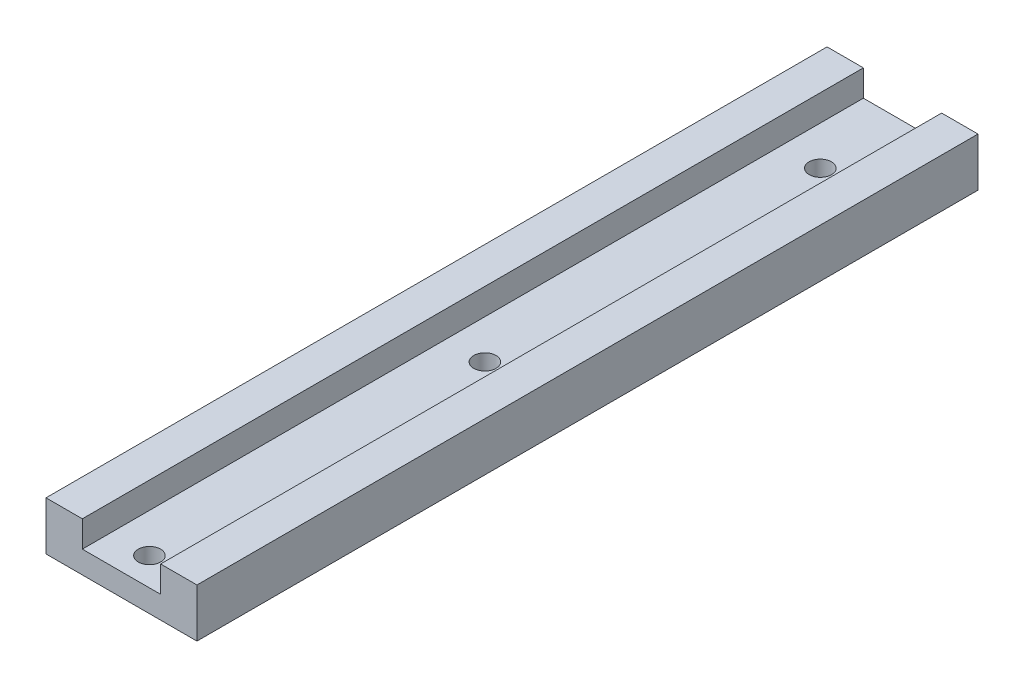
ISO-10303-21;
HEADER;
FILE_DESCRIPTION(('STEP AP214'),'2;1');
FILE_NAME('part.step','',(''),(''),'','','');
FILE_SCHEMA(('AUTOMOTIVE_DESIGN { 1 0 10303 214 1 1 1 1 }'));
ENDSEC;
DATA;
#1=APPLICATION_CONTEXT('core data for automotive mechanical design processes');
#2=APPLICATION_PROTOCOL_DEFINITION('international standard','automotive_design',2000,#1);
#3=PRODUCT_CONTEXT('',#1,'mechanical');
#4=PRODUCT('Part','Part','',(#3));
#5=PRODUCT_RELATED_PRODUCT_CATEGORY('part','',(#4));
#6=PRODUCT_DEFINITION_FORMATION('','',#4);
#7=PRODUCT_DEFINITION_CONTEXT('part definition',#1,'design');
#8=PRODUCT_DEFINITION('design','',#6,#7);
#9=PRODUCT_DEFINITION_SHAPE('','',#8);
#10=(LENGTH_UNIT() NAMED_UNIT(*) SI_UNIT(.MILLI.,.METRE.));
#11=(NAMED_UNIT(*) PLANE_ANGLE_UNIT() SI_UNIT($,.RADIAN.));
#12=(NAMED_UNIT(*) SI_UNIT($,.STERADIAN.) SOLID_ANGLE_UNIT());
#13=UNCERTAINTY_MEASURE_WITH_UNIT(LENGTH_MEASURE(1.E-05),#10,'distance_accuracy_value','');
#14=(GEOMETRIC_REPRESENTATION_CONTEXT(3) GLOBAL_UNCERTAINTY_ASSIGNED_CONTEXT((#13)) GLOBAL_UNIT_ASSIGNED_CONTEXT((#10,
#11,#12)) REPRESENTATION_CONTEXT('',''));
#15=CARTESIAN_POINT('',(0.,0.,0.));
#16=DIRECTION('',(0.,0.,1.));
#17=DIRECTION('',(1.,0.,0.));
#18=AXIS2_PLACEMENT_3D('',#15,#16,#17);
#19=CARTESIAN_POINT('',(13.5,-4.35,139.7));
#20=DIRECTION('',(-1.,0.,0.));
#21=DIRECTION('',(0.,-1.,0.));
#22=AXIS2_PLACEMENT_3D('',#19,#20,#21);
#23=PLANE('',#22);
#24=DIRECTION('',(0.,1.,0.));
#25=VECTOR('',#24,1.);
#26=CARTESIAN_POINT('',(13.5,-4.35,0.));
#27=LINE('',#26,#25);
#28=CARTESIAN_POINT('',(13.5,-4.35,0.));
#29=VERTEX_POINT('',#28);
#30=CARTESIAN_POINT('',(13.5,4.35,0.));
#31=VERTEX_POINT('',#30);
#32=EDGE_CURVE('E131',#29,#31,#27,.T.);
#33=ORIENTED_EDGE('',*,*,#32,.T.);
#34=DIRECTION('',(0.,0.,-1.));
#35=VECTOR('',#34,1.);
#36=CARTESIAN_POINT('',(13.5,4.35,139.7));
#37=LINE('',#36,#35);
#38=CARTESIAN_POINT('',(13.5,4.35,139.7));
#39=VERTEX_POINT('',#38);
#40=EDGE_CURVE('E159',#39,#31,#37,.T.);
#41=ORIENTED_EDGE('',*,*,#40,.F.);
#42=DIRECTION('',(0.,1.,0.));
#43=VECTOR('',#42,1.);
#44=CARTESIAN_POINT('',(13.5,-4.35,139.7));
#45=LINE('',#44,#43);
#46=CARTESIAN_POINT('',(13.5,-4.35,139.7));
#47=VERTEX_POINT('',#46);
#48=EDGE_CURVE('E146',#47,#39,#45,.T.);
#49=ORIENTED_EDGE('',*,*,#48,.F.);
#50=DIRECTION('',(0.,0.,-1.));
#51=VECTOR('',#50,1.);
#52=CARTESIAN_POINT('',(13.5,-4.35,139.7));
#53=LINE('',#52,#51);
#54=EDGE_CURVE('E127',#47,#29,#53,.T.);
#55=ORIENTED_EDGE('',*,*,#54,.T.);
#56=EDGE_LOOP('',(#33,#41,#49,#55));
#57=FACE_BOUND('',#56,.T.);
#58=ADVANCED_FACE('F33',(#57),#23,.F.);
#59=CARTESIAN_POINT('',(7.,4.35,139.7));
#60=DIRECTION('',(0.,-1.,0.));
#61=DIRECTION('',(1.,0.,0.));
#62=AXIS2_PLACEMENT_3D('',#59,#60,#61);
#63=PLANE('',#62);
#64=DIRECTION('',(-1.,0.,0.));
#65=VECTOR('',#64,1.);
#66=CARTESIAN_POINT('',(7.,4.35,0.));
#67=LINE('',#66,#65);
#68=CARTESIAN_POINT('',(7.,4.35,0.));
#69=VERTEX_POINT('',#68);
#70=EDGE_CURVE('E134',#31,#69,#67,.T.);
#71=ORIENTED_EDGE('',*,*,#70,.T.);
#72=DIRECTION('',(0.,0.,-1.));
#73=VECTOR('',#72,1.);
#74=CARTESIAN_POINT('',(7.,4.35,139.7));
#75=LINE('',#74,#73);
#76=CARTESIAN_POINT('',(7.,4.35,139.7));
#77=VERTEX_POINT('',#76);
#78=EDGE_CURVE('E156',#77,#69,#75,.T.);
#79=ORIENTED_EDGE('',*,*,#78,.F.);
#80=DIRECTION('',(-1.,0.,0.));
#81=VECTOR('',#80,1.);
#82=CARTESIAN_POINT('',(7.,4.35,139.7));
#83=LINE('',#82,#81);
#84=EDGE_CURVE('E94',#39,#77,#83,.T.);
#85=ORIENTED_EDGE('',*,*,#84,.F.);
#86=ORIENTED_EDGE('',*,*,#40,.T.);
#87=EDGE_LOOP('',(#71,#79,#85,#86));
#88=FACE_BOUND('',#87,.T.);
#89=ADVANCED_FACE('F182',(#88),#63,.F.);
#90=CARTESIAN_POINT('',(7.,4.35,139.7));
#91=DIRECTION('',(1.,0.,0.));
#92=DIRECTION('',(0.,1.,0.));
#93=AXIS2_PLACEMENT_3D('',#90,#91,#92);
#94=PLANE('',#93);
#95=DIRECTION('',(0.,-1.,0.));
#96=VECTOR('',#95,1.);
#97=CARTESIAN_POINT('',(7.,4.35,0.));
#98=LINE('',#97,#96);
#99=CARTESIAN_POINT('',(7.,-0.349999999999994,0.));
#100=VERTEX_POINT('',#99);
#101=EDGE_CURVE('E137',#69,#100,#98,.T.);
#102=ORIENTED_EDGE('',*,*,#101,.T.);
#103=DIRECTION('',(0.,0.,-1.));
#104=VECTOR('',#103,1.);
#105=CARTESIAN_POINT('',(7.,-0.349999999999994,139.7));
#106=LINE('',#105,#104);
#107=CARTESIAN_POINT('',(7.,-0.349999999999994,139.7));
#108=VERTEX_POINT('',#107);
#109=EDGE_CURVE('E153',#108,#100,#106,.T.);
#110=ORIENTED_EDGE('',*,*,#109,.F.);
#111=DIRECTION('',(0.,-1.,0.));
#112=VECTOR('',#111,1.);
#113=CARTESIAN_POINT('',(7.,4.35,139.7));
#114=LINE('',#113,#112);
#115=EDGE_CURVE('E202',#77,#108,#114,.T.);
#116=ORIENTED_EDGE('',*,*,#115,.F.);
#117=ORIENTED_EDGE('',*,*,#78,.T.);
#118=EDGE_LOOP('',(#102,#110,#116,#117));
#119=FACE_BOUND('',#118,.T.);
#120=ADVANCED_FACE('F173',(#119),#94,.F.);
#121=CARTESIAN_POINT('',(-7.,-0.349999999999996,139.7));
#122=DIRECTION('',(0.,-1.,0.));
#123=DIRECTION('',(1.,0.,0.));
#124=AXIS2_PLACEMENT_3D('',#121,#122,#123);
#125=PLANE('',#124);
#126=CARTESIAN_POINT('',(0.,-0.349999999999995,74.7));
#127=DIRECTION('',(0.,1.,0.));
#128=DIRECTION('',(-1.,0.,0.));
#129=AXIS2_PLACEMENT_3D('',#126,#127,#128);
#130=CIRCLE('',#129,2.);
#131=CARTESIAN_POINT('',(-2.,-0.349999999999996,74.7));
#132=VERTEX_POINT('',#131);
#133=EDGE_CURVE('E213',#132,#132,#130,.T.);
#134=ORIENTED_EDGE('',*,*,#133,.F.);
#135=EDGE_LOOP('',(#134));
#136=FACE_BOUND('',#135,.T.);
#137=CARTESIAN_POINT('',(0.,-0.349999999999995,134.7));
#138=DIRECTION('',(0.,1.,0.));
#139=DIRECTION('',(-1.,0.,0.));
#140=AXIS2_PLACEMENT_3D('',#137,#138,#139);
#141=CIRCLE('',#140,2.);
#142=CARTESIAN_POINT('',(-2.,-0.349999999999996,134.7));
#143=VERTEX_POINT('',#142);
#144=EDGE_CURVE('E210',#143,#143,#141,.T.);
#145=ORIENTED_EDGE('',*,*,#144,.F.);
#146=EDGE_LOOP('',(#145));
#147=FACE_BOUND('',#146,.T.);
#148=DIRECTION('',(-1.,0.,0.));
#149=VECTOR('',#148,1.);
#150=CARTESIAN_POINT('',(-7.,-0.349999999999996,0.));
#151=LINE('',#150,#149);
#152=CARTESIAN_POINT('',(-7.,-0.349999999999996,0.));
#153=VERTEX_POINT('',#152);
#154=EDGE_CURVE('E139',#100,#153,#151,.T.);
#155=ORIENTED_EDGE('',*,*,#154,.T.);
#156=DIRECTION('',(0.,0.,-1.));
#157=VECTOR('',#156,1.);
#158=CARTESIAN_POINT('',(-7.,-0.349999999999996,139.7));
#159=LINE('',#158,#157);
#160=CARTESIAN_POINT('',(-7.,-0.349999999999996,139.7));
#161=VERTEX_POINT('',#160);
#162=EDGE_CURVE('E150',#161,#153,#159,.T.);
#163=ORIENTED_EDGE('',*,*,#162,.F.);
#164=DIRECTION('',(-1.,0.,0.));
#165=VECTOR('',#164,1.);
#166=CARTESIAN_POINT('',(-7.,-0.349999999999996,139.7));
#167=LINE('',#166,#165);
#168=EDGE_CURVE('E204',#108,#161,#167,.T.);
#169=ORIENTED_EDGE('',*,*,#168,.F.);
#170=ORIENTED_EDGE('',*,*,#109,.T.);
#171=EDGE_LOOP('',(#155,#163,#169,#170));
#172=FACE_BOUND('',#171,.T.);
#173=CARTESIAN_POINT('',(0.,-0.349999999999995,14.7));
#174=DIRECTION('',(0.,1.,0.));
#175=DIRECTION('',(-1.,0.,0.));
#176=AXIS2_PLACEMENT_3D('',#173,#174,#175);
#177=CIRCLE('',#176,2.);
#178=CARTESIAN_POINT('',(-2.,-0.349999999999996,14.7));
#179=VERTEX_POINT('',#178);
#180=EDGE_CURVE('E11',#179,#179,#177,.T.);
#181=ORIENTED_EDGE('',*,*,#180,.F.);
#182=EDGE_LOOP('',(#181));
#183=FACE_BOUND('',#182,.T.);
#184=ADVANCED_FACE('F170',(#136,#147,#172,#183),#125,.F.);
#185=CARTESIAN_POINT('',(-7.,4.35,139.7));
#186=DIRECTION('',(-1.,0.,0.));
#187=DIRECTION('',(0.,-1.,0.));
#188=AXIS2_PLACEMENT_3D('',#185,#186,#187);
#189=PLANE('',#188);
#190=DIRECTION('',(0.,1.,0.));
#191=VECTOR('',#190,1.);
#192=CARTESIAN_POINT('',(-7.,4.35,0.));
#193=LINE('',#192,#191);
#194=CARTESIAN_POINT('',(-7.,4.35,0.));
#195=VERTEX_POINT('',#194);
#196=EDGE_CURVE('E141',#153,#195,#193,.T.);
#197=ORIENTED_EDGE('',*,*,#196,.T.);
#198=DIRECTION('',(0.,0.,-1.));
#199=VECTOR('',#198,1.);
#200=CARTESIAN_POINT('',(-7.,4.35,139.7));
#201=LINE('',#200,#199);
#202=CARTESIAN_POINT('',(-7.,4.35,139.7));
#203=VERTEX_POINT('',#202);
#204=EDGE_CURVE('E122',#203,#195,#201,.T.);
#205=ORIENTED_EDGE('',*,*,#204,.F.);
#206=DIRECTION('',(0.,1.,0.));
#207=VECTOR('',#206,1.);
#208=CARTESIAN_POINT('',(-7.,4.35,139.7));
#209=LINE('',#208,#207);
#210=EDGE_CURVE('E113',#161,#203,#209,.T.);
#211=ORIENTED_EDGE('',*,*,#210,.F.);
#212=ORIENTED_EDGE('',*,*,#162,.T.);
#213=EDGE_LOOP('',(#197,#205,#211,#212));
#214=FACE_BOUND('',#213,.T.);
#215=ADVANCED_FACE('F172',(#214),#189,.F.);
#216=CARTESIAN_POINT('',(-13.5,4.35,139.7));
#217=DIRECTION('',(0.,-1.,0.));
#218=DIRECTION('',(0.,0.,-1.));
#219=AXIS2_PLACEMENT_3D('',#216,#217,#218);
#220=PLANE('',#219);
#221=DIRECTION('',(-1.,0.,0.));
#222=VECTOR('',#221,1.);
#223=CARTESIAN_POINT('',(-13.5,4.35,0.));
#224=LINE('',#223,#222);
#225=CARTESIAN_POINT('',(-13.5,4.35,0.));
#226=VERTEX_POINT('',#225);
#227=EDGE_CURVE('E121',#195,#226,#224,.T.);
#228=ORIENTED_EDGE('',*,*,#227,.T.);
#229=DIRECTION('',(0.,0.,-1.));
#230=VECTOR('',#229,1.);
#231=CARTESIAN_POINT('',(-13.5,4.35,139.7));
#232=LINE('',#231,#230);
#233=CARTESIAN_POINT('',(-13.5,4.35,139.7));
#234=VERTEX_POINT('',#233);
#235=EDGE_CURVE('E118',#234,#226,#232,.T.);
#236=ORIENTED_EDGE('',*,*,#235,.F.);
#237=DIRECTION('',(-1.,0.,0.));
#238=VECTOR('',#237,1.);
#239=CARTESIAN_POINT('',(-13.5,4.35,139.7));
#240=LINE('',#239,#238);
#241=EDGE_CURVE('E107',#203,#234,#240,.T.);
#242=ORIENTED_EDGE('',*,*,#241,.F.);
#243=ORIENTED_EDGE('',*,*,#204,.T.);
#244=EDGE_LOOP('',(#228,#236,#242,#243));
#245=FACE_BOUND('',#244,.T.);
#246=ADVANCED_FACE('F119',(#245),#220,.F.);
#247=CARTESIAN_POINT('',(-13.5,-4.35,139.7));
#248=DIRECTION('',(1.,0.,0.));
#249=DIRECTION('',(0.,0.,-1.));
#250=AXIS2_PLACEMENT_3D('',#247,#248,#249);
#251=PLANE('',#250);
#252=DIRECTION('',(0.,-1.,0.));
#253=VECTOR('',#252,1.);
#254=CARTESIAN_POINT('',(-13.5,-4.35,0.));
#255=LINE('',#254,#253);
#256=CARTESIAN_POINT('',(-13.5,-4.35,0.));
#257=VERTEX_POINT('',#256);
#258=EDGE_CURVE('E79',#226,#257,#255,.T.);
#259=ORIENTED_EDGE('',*,*,#258,.T.);
#260=DIRECTION('',(0.,0.,-1.));
#261=VECTOR('',#260,1.);
#262=CARTESIAN_POINT('',(-13.5,-4.35,139.7));
#263=LINE('',#262,#261);
#264=CARTESIAN_POINT('',(-13.5,-4.35,139.7));
#265=VERTEX_POINT('',#264);
#266=EDGE_CURVE('E123',#265,#257,#263,.T.);
#267=ORIENTED_EDGE('',*,*,#266,.F.);
#268=DIRECTION('',(0.,-1.,0.));
#269=VECTOR('',#268,1.);
#270=CARTESIAN_POINT('',(-13.5,-4.35,139.7));
#271=LINE('',#270,#269);
#272=EDGE_CURVE('E111',#234,#265,#271,.T.);
#273=ORIENTED_EDGE('',*,*,#272,.F.);
#274=ORIENTED_EDGE('',*,*,#235,.T.);
#275=EDGE_LOOP('',(#259,#267,#273,#274));
#276=FACE_BOUND('',#275,.T.);
#277=ADVANCED_FACE('F125',(#276),#251,.F.);
#278=CARTESIAN_POINT('',(-13.5,-4.35,139.7));
#279=DIRECTION('',(0.,1.,0.));
#280=DIRECTION('',(0.,0.,1.));
#281=AXIS2_PLACEMENT_3D('',#278,#279,#280);
#282=PLANE('',#281);
#283=CARTESIAN_POINT('',(0.,-4.35,74.7));
#284=DIRECTION('',(0.,1.,0.));
#285=DIRECTION('',(-1.,0.,0.));
#286=AXIS2_PLACEMENT_3D('',#283,#284,#285);
#287=CIRCLE('',#286,2.);
#288=CARTESIAN_POINT('',(-2.,-4.35,74.7));
#289=VERTEX_POINT('',#288);
#290=EDGE_CURVE('E218',#289,#289,#287,.T.);
#291=ORIENTED_EDGE('',*,*,#290,.T.);
#292=EDGE_LOOP('',(#291));
#293=FACE_BOUND('',#292,.T.);
#294=CARTESIAN_POINT('',(0.,-4.35,134.7));
#295=DIRECTION('',(0.,1.,0.));
#296=DIRECTION('',(-1.,0.,0.));
#297=AXIS2_PLACEMENT_3D('',#294,#295,#296);
#298=CIRCLE('',#297,2.);
#299=CARTESIAN_POINT('',(-2.,-4.35,134.7));
#300=VERTEX_POINT('',#299);
#301=EDGE_CURVE('E135',#300,#300,#298,.T.);
#302=ORIENTED_EDGE('',*,*,#301,.T.);
#303=EDGE_LOOP('',(#302));
#304=FACE_BOUND('',#303,.T.);
#305=DIRECTION('',(1.,0.,0.));
#306=VECTOR('',#305,1.);
#307=CARTESIAN_POINT('',(-13.5,-4.35,0.));
#308=LINE('',#307,#306);
#309=EDGE_CURVE('E85',#257,#29,#308,.T.);
#310=ORIENTED_EDGE('',*,*,#309,.T.);
#311=ORIENTED_EDGE('',*,*,#54,.F.);
#312=DIRECTION('',(1.,0.,0.));
#313=VECTOR('',#312,1.);
#314=CARTESIAN_POINT('',(-13.5,-4.35,139.7));
#315=LINE('',#314,#313);
#316=EDGE_CURVE('E50',#265,#47,#315,.T.);
#317=ORIENTED_EDGE('',*,*,#316,.F.);
#318=ORIENTED_EDGE('',*,*,#266,.T.);
#319=EDGE_LOOP('',(#310,#311,#317,#318));
#320=FACE_BOUND('',#319,.T.);
#321=CARTESIAN_POINT('',(0.,-4.35,14.7));
#322=DIRECTION('',(0.,1.,0.));
#323=DIRECTION('',(-1.,0.,0.));
#324=AXIS2_PLACEMENT_3D('',#321,#322,#323);
#325=CIRCLE('',#324,2.);
#326=CARTESIAN_POINT('',(-2.,-4.35,14.7));
#327=VERTEX_POINT('',#326);
#328=EDGE_CURVE('E42',#327,#327,#325,.T.);
#329=ORIENTED_EDGE('',*,*,#328,.T.);
#330=EDGE_LOOP('',(#329));
#331=FACE_BOUND('',#330,.T.);
#332=ADVANCED_FACE('F163',(#293,#304,#320,#331),#282,.F.);
#333=CARTESIAN_POINT('',(0.,0.,139.7));
#334=DIRECTION('',(0.,0.,-1.));
#335=DIRECTION('',(-1.,0.,0.));
#336=AXIS2_PLACEMENT_3D('',#333,#334,#335);
#337=PLANE('',#336);
#338=ORIENTED_EDGE('',*,*,#48,.T.);
#339=ORIENTED_EDGE('',*,*,#84,.T.);
#340=ORIENTED_EDGE('',*,*,#115,.T.);
#341=ORIENTED_EDGE('',*,*,#168,.T.);
#342=ORIENTED_EDGE('',*,*,#210,.T.);
#343=ORIENTED_EDGE('',*,*,#241,.T.);
#344=ORIENTED_EDGE('',*,*,#272,.T.);
#345=ORIENTED_EDGE('',*,*,#316,.T.);
#346=EDGE_LOOP('',(#338,#339,#340,#341,#342,#343,#344,#345));
#347=FACE_BOUND('',#346,.T.);
#348=ADVANCED_FACE('F109',(#347),#337,.F.);
#349=CARTESIAN_POINT('',(0.,0.,0.));
#350=DIRECTION('',(0.,0.,-1.));
#351=DIRECTION('',(-1.,0.,0.));
#352=AXIS2_PLACEMENT_3D('',#349,#350,#351);
#353=PLANE('',#352);
#354=ORIENTED_EDGE('',*,*,#32,.F.);
#355=ORIENTED_EDGE('',*,*,#309,.F.);
#356=ORIENTED_EDGE('',*,*,#258,.F.);
#357=ORIENTED_EDGE('',*,*,#227,.F.);
#358=ORIENTED_EDGE('',*,*,#196,.F.);
#359=ORIENTED_EDGE('',*,*,#154,.F.);
#360=ORIENTED_EDGE('',*,*,#101,.F.);
#361=ORIENTED_EDGE('',*,*,#70,.F.);
#362=EDGE_LOOP('',(#354,#355,#356,#357,#358,#359,#360,#361));
#363=FACE_BOUND('',#362,.T.);
#364=ADVANCED_FACE('F197',(#363),#353,.T.);
#365=CARTESIAN_POINT('',(0.,-4.35,134.7));
#366=DIRECTION('',(0.,1.,0.));
#367=DIRECTION('',(-1.,0.,0.));
#368=AXIS2_PLACEMENT_3D('',#365,#366,#367);
#369=CYLINDRICAL_SURFACE('',#368,2.);
#370=ORIENTED_EDGE('',*,*,#301,.F.);
#371=EDGE_LOOP('',(#370));
#372=FACE_BOUND('',#371,.T.);
#373=ORIENTED_EDGE('',*,*,#144,.T.);
#374=EDGE_LOOP('',(#373));
#375=FACE_BOUND('',#374,.T.);
#376=ADVANCED_FACE('F226',(#372,#375),#369,.F.);
#377=CARTESIAN_POINT('',(0.,-4.35,74.7));
#378=DIRECTION('',(0.,1.,0.));
#379=DIRECTION('',(-1.,0.,0.));
#380=AXIS2_PLACEMENT_3D('',#377,#378,#379);
#381=CYLINDRICAL_SURFACE('',#380,2.);
#382=ORIENTED_EDGE('',*,*,#290,.F.);
#383=EDGE_LOOP('',(#382));
#384=FACE_BOUND('',#383,.T.);
#385=ORIENTED_EDGE('',*,*,#133,.T.);
#386=EDGE_LOOP('',(#385));
#387=FACE_BOUND('',#386,.T.);
#388=ADVANCED_FACE('F167',(#384,#387),#381,.F.);
#389=CARTESIAN_POINT('',(0.,-4.35,14.7));
#390=DIRECTION('',(0.,1.,0.));
#391=DIRECTION('',(-1.,0.,0.));
#392=AXIS2_PLACEMENT_3D('',#389,#390,#391);
#393=CYLINDRICAL_SURFACE('',#392,2.);
#394=ORIENTED_EDGE('',*,*,#328,.F.);
#395=EDGE_LOOP('',(#394));
#396=FACE_BOUND('',#395,.T.);
#397=ORIENTED_EDGE('',*,*,#180,.T.);
#398=EDGE_LOOP('',(#397));
#399=FACE_BOUND('',#398,.T.);
#400=ADVANCED_FACE('F35',(#396,#399),#393,.F.);
#401=CLOSED_SHELL('',(#58,#89,#120,#184,#215,#246,#277,#332,#348,#364,#376,#388,#400));
#402=MANIFOLD_SOLID_BREP('B2',#401);
#403=ADVANCED_BREP_SHAPE_REPRESENTATION('',(#18,#402),#14);
#404=SHAPE_DEFINITION_REPRESENTATION(#9,#403);
ENDSEC;
END-ISO-10303-21;
